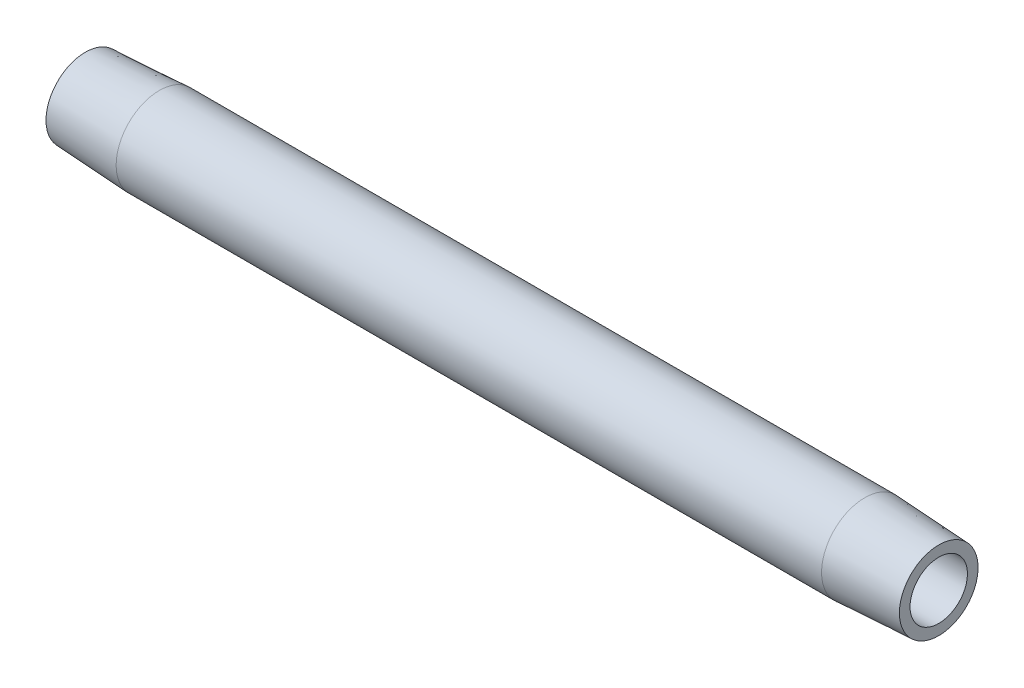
ISO-10303-21;
HEADER;
FILE_DESCRIPTION(('STEP AP214'),'2;1');
FILE_NAME('part.step','',(''),(''),'','','');
FILE_SCHEMA(('AUTOMOTIVE_DESIGN { 1 0 10303 214 1 1 1 1 }'));
ENDSEC;
DATA;
#1=APPLICATION_CONTEXT('core data for automotive mechanical design processes');
#2=APPLICATION_PROTOCOL_DEFINITION('international standard','automotive_design',2000,#1);
#3=PRODUCT_CONTEXT('',#1,'mechanical');
#4=PRODUCT('Part','Part','',(#3));
#5=PRODUCT_RELATED_PRODUCT_CATEGORY('part','',(#4));
#6=PRODUCT_DEFINITION_FORMATION('','',#4);
#7=PRODUCT_DEFINITION_CONTEXT('part definition',#1,'design');
#8=PRODUCT_DEFINITION('design','',#6,#7);
#9=PRODUCT_DEFINITION_SHAPE('','',#8);
#10=(LENGTH_UNIT() NAMED_UNIT(*) SI_UNIT(.MILLI.,.METRE.));
#11=(NAMED_UNIT(*) PLANE_ANGLE_UNIT() SI_UNIT($,.RADIAN.));
#12=(NAMED_UNIT(*) SI_UNIT($,.STERADIAN.) SOLID_ANGLE_UNIT());
#13=UNCERTAINTY_MEASURE_WITH_UNIT(LENGTH_MEASURE(1.E-05),#10,'distance_accuracy_value','');
#14=(GEOMETRIC_REPRESENTATION_CONTEXT(3) GLOBAL_UNCERTAINTY_ASSIGNED_CONTEXT((#13)) GLOBAL_UNIT_ASSIGNED_CONTEXT((#10,
#11,#12)) REPRESENTATION_CONTEXT('',''));
#15=CARTESIAN_POINT('',(0.,0.,0.));
#16=DIRECTION('',(0.,0.,1.));
#17=DIRECTION('',(1.,0.,0.));
#18=AXIS2_PLACEMENT_3D('',#15,#16,#17);
#19=CARTESIAN_POINT('',(0.476141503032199,0.,0.));
#20=DIRECTION('',(-1.,0.,0.));
#21=DIRECTION('',(0.,0.,1.));
#22=AXIS2_PLACEMENT_3D('',#19,#20,#21);
#23=CYLINDRICAL_SURFACE('',#22,5.14349999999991);
#24=CARTESIAN_POINT('',(8.8100393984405,0.,0.));
#25=DIRECTION('',(-1.,0.,0.));
#26=DIRECTION('',(0.,0.,1.));
#27=AXIS2_PLACEMENT_3D('',#24,#25,#26);
#28=CIRCLE('',#27,5.14349999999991);
#29=CARTESIAN_POINT('',(8.8100393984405,0.,5.14349999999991));
#30=VERTEX_POINT('',#29);
#31=EDGE_CURVE('E10',#30,#30,#28,.T.);
#32=ORIENTED_EDGE('',*,*,#31,.F.);
#33=EDGE_LOOP('',(#32));
#34=FACE_BOUND('',#33,.T.);
#35=CARTESIAN_POINT('',(92.7899606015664,0.,0.));
#36=DIRECTION('',(-1.,0.,0.));
#37=DIRECTION('',(0.,0.,1.));
#38=AXIS2_PLACEMENT_3D('',#35,#36,#37);
#39=CIRCLE('',#38,5.14349999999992);
#40=CARTESIAN_POINT('',(92.7899606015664,0.,5.14349999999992));
#41=VERTEX_POINT('',#40);
#42=EDGE_CURVE('E52',#41,#41,#39,.T.);
#43=ORIENTED_EDGE('',*,*,#42,.T.);
#44=EDGE_LOOP('',(#43));
#45=FACE_BOUND('',#44,.T.);
#46=ADVANCED_FACE('F30',(#34,#45),#23,.T.);
#47=CARTESIAN_POINT('',(8.8100393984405,0.,0.));
#48=DIRECTION('',(1.,0.,0.));
#49=DIRECTION('',(0.,0.,-1.));
#50=AXIS2_PLACEMENT_3D('',#47,#48,#49);
#51=CONICAL_SURFACE('',#50,5.14349999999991,0.0523598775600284);
#52=CARTESIAN_POINT('',(0.,0.,0.));
#53=DIRECTION('',(-1.,0.,0.));
#54=DIRECTION('',(0.,0.,1.));
#55=AXIS2_PLACEMENT_3D('',#52,#53,#54);
#56=CIRCLE('',#55,4.68178539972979);
#57=CARTESIAN_POINT('',(0.,0.,4.68178539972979));
#58=VERTEX_POINT('',#57);
#59=EDGE_CURVE('E36',#58,#58,#56,.T.);
#60=ORIENTED_EDGE('',*,*,#59,.F.);
#61=EDGE_LOOP('',(#60));
#62=FACE_BOUND('',#61,.T.);
#63=ORIENTED_EDGE('',*,*,#31,.T.);
#64=EDGE_LOOP('',(#63));
#65=FACE_BOUND('',#64,.T.);
#66=ADVANCED_FACE('F77',(#62,#65),#51,.T.);
#67=CARTESIAN_POINT('',(0.,4.68178539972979,0.));
#68=DIRECTION('',(1.,0.,0.));
#69=DIRECTION('',(0.,0.,-1.));
#70=AXIS2_PLACEMENT_3D('',#67,#68,#69);
#71=PLANE('',#70);
#72=CARTESIAN_POINT('',(0.,0.,0.));
#73=DIRECTION('',(-1.,0.,0.));
#74=DIRECTION('',(0.,0.,1.));
#75=AXIS2_PLACEMENT_3D('',#72,#73,#74);
#76=CIRCLE('',#75,3.4163);
#77=CARTESIAN_POINT('',(0.,0.,3.4163));
#78=VERTEX_POINT('',#77);
#79=EDGE_CURVE('E40',#78,#78,#76,.T.);
#80=ORIENTED_EDGE('',*,*,#79,.F.);
#81=EDGE_LOOP('',(#80));
#82=FACE_BOUND('',#81,.T.);
#83=ORIENTED_EDGE('',*,*,#59,.T.);
#84=EDGE_LOOP('',(#83));
#85=FACE_BOUND('',#84,.T.);
#86=ADVANCED_FACE('F72',(#82,#85),#71,.F.);
#87=CARTESIAN_POINT('',(0.476141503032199,0.,0.));
#88=DIRECTION('',(-1.,0.,0.));
#89=DIRECTION('',(0.,0.,1.));
#90=AXIS2_PLACEMENT_3D('',#87,#88,#89);
#91=CYLINDRICAL_SURFACE('',#90,3.4163);
#92=CARTESIAN_POINT('',(101.6,0.,0.));
#93=DIRECTION('',(-1.,0.,0.));
#94=DIRECTION('',(0.,0.,1.));
#95=AXIS2_PLACEMENT_3D('',#92,#93,#94);
#96=CIRCLE('',#95,3.41630000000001);
#97=CARTESIAN_POINT('',(101.6,0.,3.41630000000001));
#98=VERTEX_POINT('',#97);
#99=EDGE_CURVE('E44',#98,#98,#96,.T.);
#100=ORIENTED_EDGE('',*,*,#99,.F.);
#101=EDGE_LOOP('',(#100));
#102=FACE_BOUND('',#101,.T.);
#103=ORIENTED_EDGE('',*,*,#79,.T.);
#104=EDGE_LOOP('',(#103));
#105=FACE_BOUND('',#104,.T.);
#106=ADVANCED_FACE('F66',(#102,#105),#91,.F.);
#107=CARTESIAN_POINT('',(101.6,3.41630000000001,0.));
#108=DIRECTION('',(-1.,0.,0.));
#109=DIRECTION('',(0.,0.,1.));
#110=AXIS2_PLACEMENT_3D('',#107,#108,#109);
#111=PLANE('',#110);
#112=CARTESIAN_POINT('',(101.6,0.,0.));
#113=DIRECTION('',(-1.,0.,0.));
#114=DIRECTION('',(0.,0.,1.));
#115=AXIS2_PLACEMENT_3D('',#112,#113,#114);
#116=CIRCLE('',#115,4.68178539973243);
#117=CARTESIAN_POINT('',(101.6,0.,4.68178539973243));
#118=VERTEX_POINT('',#117);
#119=EDGE_CURVE('E49',#118,#118,#116,.T.);
#120=ORIENTED_EDGE('',*,*,#119,.F.);
#121=EDGE_LOOP('',(#120));
#122=FACE_BOUND('',#121,.T.);
#123=ORIENTED_EDGE('',*,*,#99,.T.);
#124=EDGE_LOOP('',(#123));
#125=FACE_BOUND('',#124,.T.);
#126=ADVANCED_FACE('F60',(#122,#125),#111,.F.);
#127=CARTESIAN_POINT('',(101.6,0.,0.));
#128=DIRECTION('',(-1.,0.,0.));
#129=DIRECTION('',(0.,0.,1.));
#130=AXIS2_PLACEMENT_3D('',#127,#128,#129);
#131=CONICAL_SURFACE('',#130,4.68178539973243,0.0523598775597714);
#132=ORIENTED_EDGE('',*,*,#42,.F.);
#133=EDGE_LOOP('',(#132));
#134=FACE_BOUND('',#133,.T.);
#135=ORIENTED_EDGE('',*,*,#119,.T.);
#136=EDGE_LOOP('',(#135));
#137=FACE_BOUND('',#136,.T.);
#138=ADVANCED_FACE('F57',(#134,#137),#131,.T.);
#139=CLOSED_SHELL('',(#46,#66,#86,#106,#126,#138));
#140=MANIFOLD_SOLID_BREP('B2',#139);
#141=ADVANCED_BREP_SHAPE_REPRESENTATION('',(#18,#140),#14);
#142=SHAPE_DEFINITION_REPRESENTATION(#9,#141);
ENDSEC;
END-ISO-10303-21;
